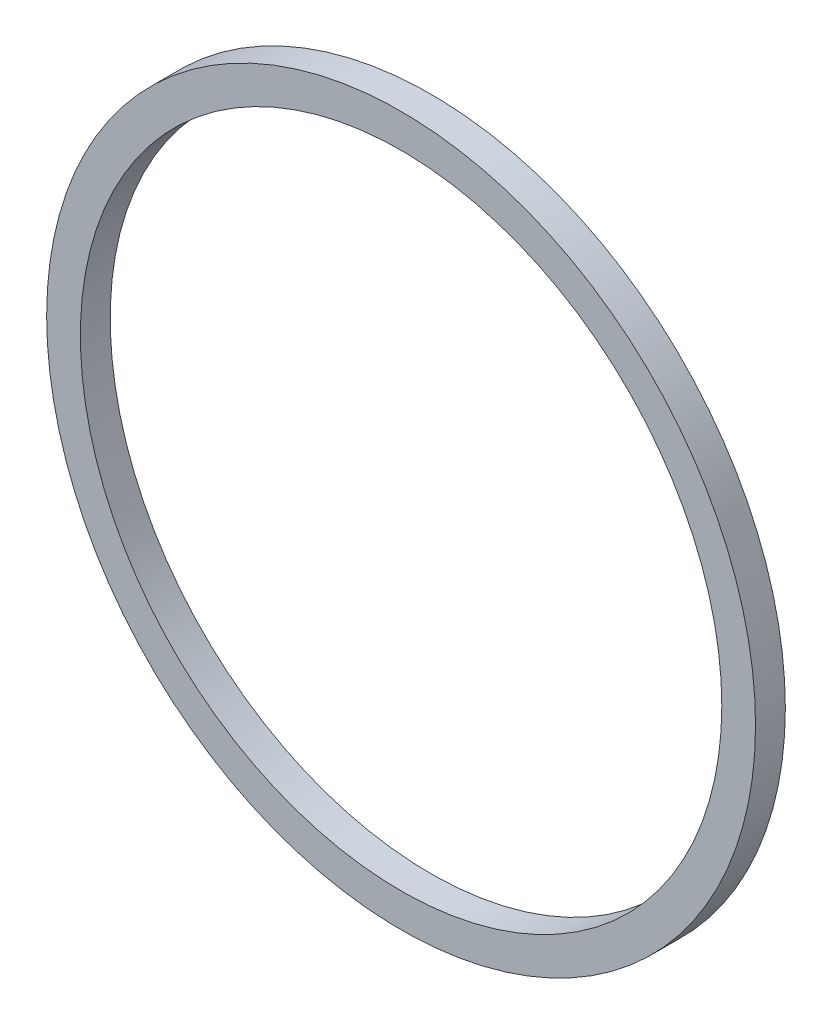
from build123d import *

# Parameters (mm, degrees)
ESQUISSE1_R          = 11.88
ESQUISSE1_R_2        = 10.75
BASE_EXTRUSION_DEPTH = 1


with BuildPart() as part:
    # Esquisse1 → Base-Extrusion (new body)
    with BuildSketch(Plane.XY):
        Circle(ESQUISSE1_R)
        Circle(ESQUISSE1_R_2, mode=Mode.SUBTRACT)
    extrude(amount=BASE_EXTRUSION_DEPTH)


solid = part.part
